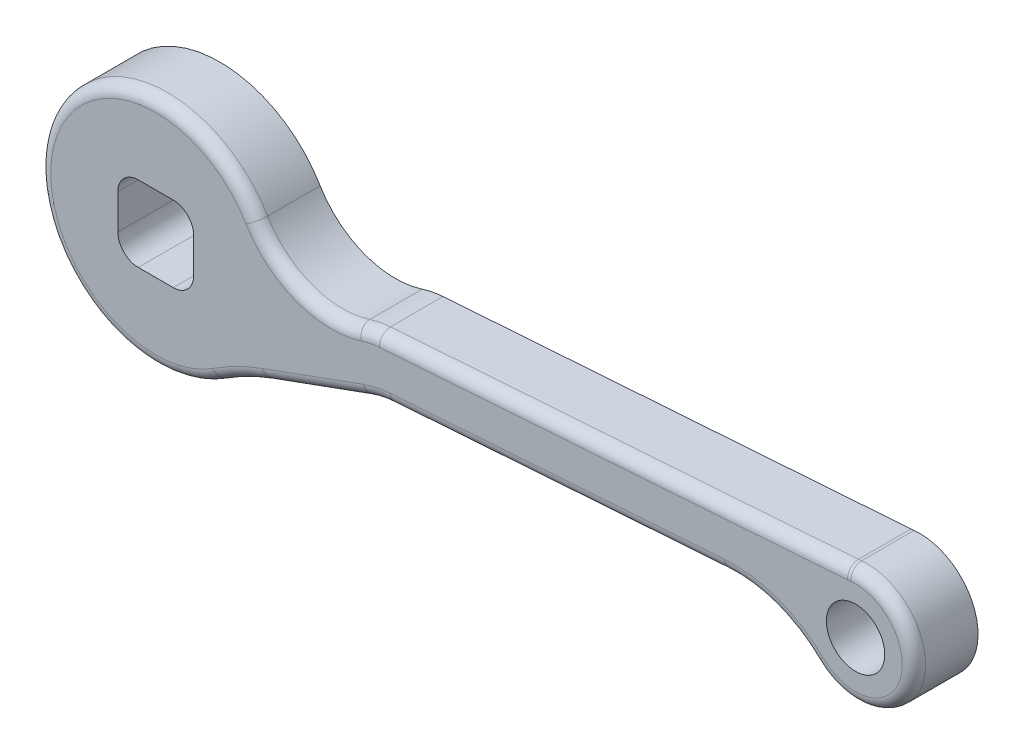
from build123d import *

# Parameters (mm, degrees)
ESQUISSE1_R      = 5
EXTRUSION1_DEPTH = 11
CONG_6_R         = 2


with BuildPart() as part:
    # Esquisse1 → Extrusion1 (new body)
    with BuildSketch(Plane.XY):
        with BuildLine():
            Line((97.704181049, -1.569898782), (40.343326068, -5.580960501))
            ThreePointArc((40.343326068, -5.580960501), (38.270997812, -5.872207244), (36.259371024, -6.449031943))
            Line((36.259371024, -6.449031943), (19, -12.730929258))
            ThreePointArc((19, -12.730929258), (14.832016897, -14.521696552), (10.893601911, -16.77287803))
            ThreePointArc((10.893601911, -16.77287803), (-19.476948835, 4.544058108), (17.191287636, 10.22054937))
            ThreePointArc((17.191287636, 10.22054937), (24.782818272, 3.854230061), (34.687438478, 3.609572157))
            ThreePointArc((34.687438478, 3.609572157), (36.444792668, 4.060847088), (38.243776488, 4.296643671))
            Line((38.243776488, 4.296643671), (118.500353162, 9.908730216))
            ThreePointArc((118.500353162, 9.908730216), (118.767863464, 9.929240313), (119.035074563, 9.953337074))
            ThreePointArc((119.035074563, 9.953337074), (129.437294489, -3.307185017), (113.033103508, -7.173726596))
            ThreePointArc((113.033103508, -7.173726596), (105.966277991, -2.737017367), (97.704181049, -1.569898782))
        make_face()
        with Locations((120, 0)):
            Circle(ESQUISSE1_R, mode=Mode.SUBTRACT)
        with BuildLine():
            Line((-3, 6.5), (3, 6.5))
            ThreePointArc((3, 6.5), (5.474873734, 5.474873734), (6.5, 3))
            Line((6.5, 3), (6.5, -3))
            ThreePointArc((6.5, -3), (5.474873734, -5.474873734), (3, -6.5))
            Line((3, -6.5), (-3, -6.5))
            ThreePointArc((-3, -6.5), (-5.474873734, -5.474873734), (-6.5, -3))
            Line((-6.5, -3), (-6.5, 3))
            ThreePointArc((-6.5, 3), (-5.474873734, 5.474873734), (-3, 6.5))
        make_face(mode=Mode.SUBTRACT)
    extrude(amount=EXTRUSION1_DEPTH)

    # Cong_6
    cong_6_edges = [part.edges().sort_by_distance(p)[0] for p in [
        (14.832016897, -14.521696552, 11),
        (27.629685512, -9.589980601, 11),
        (38.270997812, -5.872207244, 11),
        (69.023753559, -3.575429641, 11),
        (105.966277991, -2.737017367, 11),
        (129.437294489, -3.307185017, 11),
        (118.767863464, 9.929240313, 11),
        (78.372064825, 7.102686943, 11),
        (36.444792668, 4.060847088, 11),
        (24.782818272, 3.854230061, 11),
        (-19.476948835, 4.544058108, 11),
    ]]
    fillet(cong_6_edges, radius=CONG_6_R)


solid = part.part
